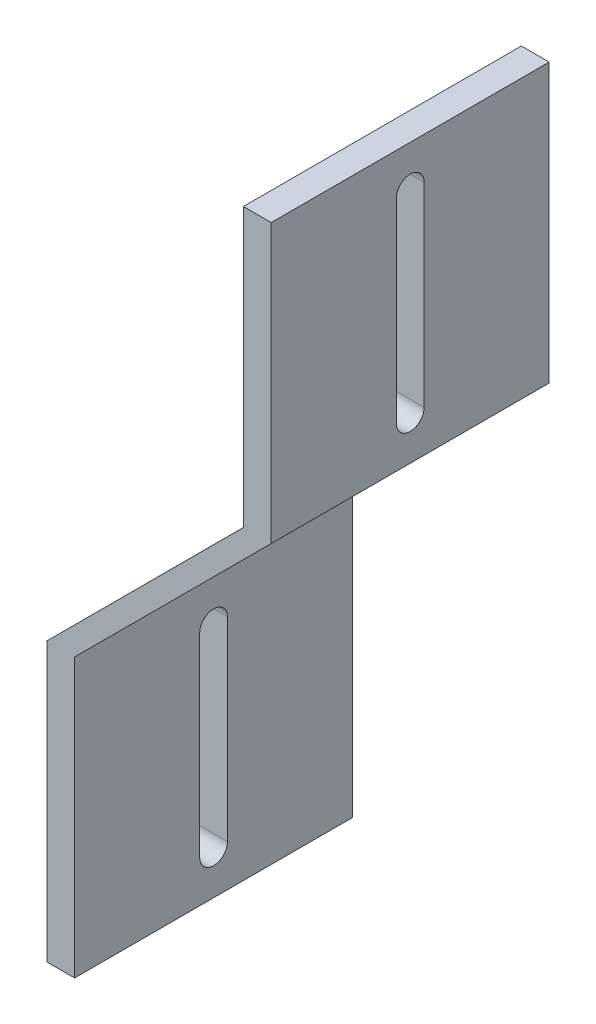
ISO-10303-21;
HEADER;
FILE_DESCRIPTION(('STEP AP214'),'2;1');
FILE_NAME('part.step','',(''),(''),'','','');
FILE_SCHEMA(('AUTOMOTIVE_DESIGN { 1 0 10303 214 1 1 1 1 }'));
ENDSEC;
DATA;
#1=APPLICATION_CONTEXT('core data for automotive mechanical design processes');
#2=APPLICATION_PROTOCOL_DEFINITION('international standard','automotive_design',2000,#1);
#3=PRODUCT_CONTEXT('',#1,'mechanical');
#4=PRODUCT('Part','Part','',(#3));
#5=PRODUCT_RELATED_PRODUCT_CATEGORY('part','',(#4));
#6=PRODUCT_DEFINITION_FORMATION('','',#4);
#7=PRODUCT_DEFINITION_CONTEXT('part definition',#1,'design');
#8=PRODUCT_DEFINITION('design','',#6,#7);
#9=PRODUCT_DEFINITION_SHAPE('','',#8);
#10=(LENGTH_UNIT() NAMED_UNIT(*) SI_UNIT(.MILLI.,.METRE.));
#11=(NAMED_UNIT(*) PLANE_ANGLE_UNIT() SI_UNIT($,.RADIAN.));
#12=(NAMED_UNIT(*) SI_UNIT($,.STERADIAN.) SOLID_ANGLE_UNIT());
#13=UNCERTAINTY_MEASURE_WITH_UNIT(LENGTH_MEASURE(1.E-05),#10,'distance_accuracy_value','');
#14=(GEOMETRIC_REPRESENTATION_CONTEXT(3) GLOBAL_UNCERTAINTY_ASSIGNED_CONTEXT((#13)) GLOBAL_UNIT_ASSIGNED_CONTEXT((#10,
#11,#12)) REPRESENTATION_CONTEXT('',''));
#15=CARTESIAN_POINT('',(0.,0.,0.));
#16=DIRECTION('',(0.,0.,1.));
#17=DIRECTION('',(1.,0.,0.));
#18=AXIS2_PLACEMENT_3D('',#15,#16,#17);
#19=CARTESIAN_POINT('',(12.0270056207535,39.6279642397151,50.8));
#20=DIRECTION('',(-1.,0.,0.));
#21=DIRECTION('',(0.,-1.,0.));
#22=AXIS2_PLACEMENT_3D('',#19,#20,#21);
#23=PLANE('',#22);
#24=DIRECTION('',(0.,-1.,0.));
#25=VECTOR('',#24,1.);
#26=CARTESIAN_POINT('',(12.0270056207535,-3.55203576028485,22.86));
#27=LINE('',#26,#25);
#28=CARTESIAN_POINT('',(12.0270056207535,32.0079642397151,22.86));
#29=VERTEX_POINT('',#28);
#30=CARTESIAN_POINT('',(12.0270056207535,-3.55203576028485,22.86));
#31=VERTEX_POINT('',#30);
#32=EDGE_CURVE('E153',#29,#31,#27,.T.);
#33=ORIENTED_EDGE('',*,*,#32,.T.);
#34=CARTESIAN_POINT('',(12.0270056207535,-3.55203576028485,25.4));
#35=DIRECTION('',(-1.,0.,0.));
#36=DIRECTION('',(0.,-1.,0.));
#37=AXIS2_PLACEMENT_3D('',#34,#35,#36);
#38=CIRCLE('',#37,2.54);
#39=CARTESIAN_POINT('',(12.0270056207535,-3.55203576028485,27.94));
#40=VERTEX_POINT('',#39);
#41=EDGE_CURVE('E147',#31,#40,#38,.T.);
#42=ORIENTED_EDGE('',*,*,#41,.T.);
#43=DIRECTION('',(0.,1.,0.));
#44=VECTOR('',#43,1.);
#45=CARTESIAN_POINT('',(12.0270056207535,-3.55203576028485,27.94));
#46=LINE('',#45,#44);
#47=CARTESIAN_POINT('',(12.0270056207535,32.0079642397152,27.94));
#48=VERTEX_POINT('',#47);
#49=EDGE_CURVE('E156',#40,#48,#46,.T.);
#50=ORIENTED_EDGE('',*,*,#49,.T.);
#51=CARTESIAN_POINT('',(12.0270056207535,32.0079642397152,25.4));
#52=DIRECTION('',(-1.,0.,0.));
#53=DIRECTION('',(0.,-1.,0.));
#54=AXIS2_PLACEMENT_3D('',#51,#52,#53);
#55=CIRCLE('',#54,2.54);
#56=EDGE_CURVE('E47',#48,#29,#55,.T.);
#57=ORIENTED_EDGE('',*,*,#56,.T.);
#58=EDGE_LOOP('',(#33,#42,#50,#57));
#59=FACE_BOUND('',#58,.T.);
#60=DIRECTION('',(0.,1.,0.));
#61=VECTOR('',#60,1.);
#62=CARTESIAN_POINT('',(12.0270056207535,39.6279642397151,0.));
#63=LINE('',#62,#61);
#64=CARTESIAN_POINT('',(12.0270056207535,-11.1720357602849,0.));
#65=VERTEX_POINT('',#64);
#66=CARTESIAN_POINT('',(12.0270056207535,39.6279642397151,0.));
#67=VERTEX_POINT('',#66);
#68=EDGE_CURVE('E206',#65,#67,#63,.T.);
#69=ORIENTED_EDGE('',*,*,#68,.T.);
#70=DIRECTION('',(0.,0.,-1.));
#71=VECTOR('',#70,1.);
#72=CARTESIAN_POINT('',(12.0270056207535,39.6279642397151,50.8));
#73=LINE('',#72,#71);
#74=CARTESIAN_POINT('',(12.0270056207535,39.6279642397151,50.8));
#75=VERTEX_POINT('',#74);
#76=EDGE_CURVE('E11',#75,#67,#73,.T.);
#77=ORIENTED_EDGE('',*,*,#76,.F.);
#78=DIRECTION('',(0.,1.,0.));
#79=VECTOR('',#78,1.);
#80=CARTESIAN_POINT('',(12.0270056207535,39.6279642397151,50.8));
#81=LINE('',#80,#79);
#82=CARTESIAN_POINT('',(12.0270056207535,-11.1720357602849,50.8));
#83=VERTEX_POINT('',#82);
#84=EDGE_CURVE('E213',#83,#75,#81,.T.);
#85=ORIENTED_EDGE('',*,*,#84,.F.);
#86=DIRECTION('',(0.,0.,-1.));
#87=VECTOR('',#86,1.);
#88=CARTESIAN_POINT('',(12.0270056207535,-11.1720357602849,50.8));
#89=LINE('',#88,#87);
#90=EDGE_CURVE('E231',#83,#65,#89,.T.);
#91=ORIENTED_EDGE('',*,*,#90,.T.);
#92=EDGE_LOOP('',(#69,#77,#85,#91));
#93=FACE_BOUND('',#92,.T.);
#94=ADVANCED_FACE('F33',(#59,#93),#23,.F.);
#95=CARTESIAN_POINT('',(12.0270056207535,39.6279642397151,50.8));
#96=DIRECTION('',(-0.707,0.707213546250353,0.));
#97=DIRECTION('',(-0.707213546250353,-0.707,0.));
#98=AXIS2_PLACEMENT_3D('',#95,#96,#97);
#99=PLANE('',#98);
#100=DIRECTION('',(0.707213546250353,0.707,0.));
#101=VECTOR('',#100,1.);
#102=CARTESIAN_POINT('',(12.0270056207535,39.6279642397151,0.));
#103=LINE('',#102,#101);
#104=CARTESIAN_POINT('',(47.9534537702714,75.5435642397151,0.));
#105=VERTEX_POINT('',#104);
#106=EDGE_CURVE('E234',#67,#105,#103,.T.);
#107=ORIENTED_EDGE('',*,*,#106,.T.);
#108=DIRECTION('',(0.,0.,-1.));
#109=VECTOR('',#108,1.);
#110=CARTESIAN_POINT('',(47.9534537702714,75.5435642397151,50.8));
#111=LINE('',#110,#109);
#112=CARTESIAN_POINT('',(47.9534537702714,75.5435642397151,50.8));
#113=VERTEX_POINT('',#112);
#114=EDGE_CURVE('E40',#113,#105,#111,.T.);
#115=ORIENTED_EDGE('',*,*,#114,.F.);
#116=DIRECTION('',(0.707213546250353,0.707,0.));
#117=VECTOR('',#116,1.);
#118=CARTESIAN_POINT('',(12.0270056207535,39.6279642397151,50.8));
#119=LINE('',#118,#117);
#120=EDGE_CURVE('E216',#75,#113,#119,.T.);
#121=ORIENTED_EDGE('',*,*,#120,.F.);
#122=ORIENTED_EDGE('',*,*,#76,.T.);
#123=EDGE_LOOP('',(#107,#115,#121,#122));
#124=FACE_BOUND('',#123,.T.);
#125=ADVANCED_FACE('F291',(#124),#99,.F.);
#126=CARTESIAN_POINT('',(47.9534537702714,126.343564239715,50.8));
#127=DIRECTION('',(-1.,0.,0.));
#128=DIRECTION('',(0.,-1.,0.));
#129=AXIS2_PLACEMENT_3D('',#126,#127,#128);
#130=PLANE('',#129);
#131=DIRECTION('',(0.,-1.,0.));
#132=VECTOR('',#131,1.);
#133=CARTESIAN_POINT('',(47.9534537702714,83.1293378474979,22.86));
#134=LINE('',#133,#132);
#135=CARTESIAN_POINT('',(47.9534537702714,118.757790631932,22.86));
#136=VERTEX_POINT('',#135);
#137=CARTESIAN_POINT('',(47.9534537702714,83.1293378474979,22.86));
#138=VERTEX_POINT('',#137);
#139=EDGE_CURVE('E191',#136,#138,#134,.T.);
#140=ORIENTED_EDGE('',*,*,#139,.T.);
#141=CARTESIAN_POINT('',(47.9534537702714,83.1293378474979,25.4));
#142=DIRECTION('',(-1.,0.,0.));
#143=DIRECTION('',(0.,-1.,0.));
#144=AXIS2_PLACEMENT_3D('',#141,#142,#143);
#145=CIRCLE('',#144,2.54);
#146=CARTESIAN_POINT('',(47.9534537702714,83.1293378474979,27.94));
#147=VERTEX_POINT('',#146);
#148=EDGE_CURVE('E181',#138,#147,#145,.T.);
#149=ORIENTED_EDGE('',*,*,#148,.T.);
#150=DIRECTION('',(0.,1.,0.));
#151=VECTOR('',#150,1.);
#152=CARTESIAN_POINT('',(47.9534537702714,83.1293378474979,27.94));
#153=LINE('',#152,#151);
#154=CARTESIAN_POINT('',(47.9534537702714,118.757790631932,27.94));
#155=VERTEX_POINT('',#154);
#156=EDGE_CURVE('E184',#147,#155,#153,.T.);
#157=ORIENTED_EDGE('',*,*,#156,.T.);
#158=CARTESIAN_POINT('',(47.9534537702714,118.757790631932,25.4));
#159=DIRECTION('',(-1.,0.,0.));
#160=DIRECTION('',(0.,-1.,0.));
#161=AXIS2_PLACEMENT_3D('',#158,#159,#160);
#162=CIRCLE('',#161,2.54);
#163=EDGE_CURVE('E188',#155,#136,#162,.T.);
#164=ORIENTED_EDGE('',*,*,#163,.T.);
#165=EDGE_LOOP('',(#140,#149,#157,#164));
#166=FACE_BOUND('',#165,.T.);
#167=DIRECTION('',(0.,1.,0.));
#168=VECTOR('',#167,1.);
#169=CARTESIAN_POINT('',(47.9534537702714,126.343564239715,0.));
#170=LINE('',#169,#168);
#171=CARTESIAN_POINT('',(47.9534537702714,126.343564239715,0.));
#172=VERTEX_POINT('',#171);
#173=EDGE_CURVE('E236',#105,#172,#170,.T.);
#174=ORIENTED_EDGE('',*,*,#173,.T.);
#175=DIRECTION('',(0.,0.,-1.));
#176=VECTOR('',#175,1.);
#177=CARTESIAN_POINT('',(47.9534537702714,126.343564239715,50.8));
#178=LINE('',#177,#176);
#179=CARTESIAN_POINT('',(47.9534537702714,126.343564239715,50.8));
#180=VERTEX_POINT('',#179);
#181=EDGE_CURVE('E261',#180,#172,#178,.T.);
#182=ORIENTED_EDGE('',*,*,#181,.F.);
#183=DIRECTION('',(0.,1.,0.));
#184=VECTOR('',#183,1.);
#185=CARTESIAN_POINT('',(47.9534537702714,126.343564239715,50.8));
#186=LINE('',#185,#184);
#187=EDGE_CURVE('E219',#113,#180,#186,.T.);
#188=ORIENTED_EDGE('',*,*,#187,.F.);
#189=ORIENTED_EDGE('',*,*,#114,.T.);
#190=EDGE_LOOP('',(#174,#182,#188,#189));
#191=FACE_BOUND('',#190,.T.);
#192=ADVANCED_FACE('F268',(#166,#191),#130,.F.);
#193=CARTESIAN_POINT('',(42.8734537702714,126.343564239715,50.8));
#194=DIRECTION('',(0.,-1.,0.));
#195=DIRECTION('',(0.,0.,-1.));
#196=AXIS2_PLACEMENT_3D('',#193,#194,#195);
#197=PLANE('',#196);
#198=DIRECTION('',(-1.,0.,0.));
#199=VECTOR('',#198,1.);
#200=CARTESIAN_POINT('',(42.8734537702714,126.343564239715,0.));
#201=LINE('',#200,#199);
#202=CARTESIAN_POINT('',(42.8734537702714,126.343564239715,0.));
#203=VERTEX_POINT('',#202);
#204=EDGE_CURVE('E238',#172,#203,#201,.T.);
#205=ORIENTED_EDGE('',*,*,#204,.T.);
#206=DIRECTION('',(0.,0.,-1.));
#207=VECTOR('',#206,1.);
#208=CARTESIAN_POINT('',(42.8734537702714,126.343564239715,50.8));
#209=LINE('',#208,#207);
#210=CARTESIAN_POINT('',(42.8734537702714,126.343564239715,50.8));
#211=VERTEX_POINT('',#210);
#212=EDGE_CURVE('E258',#211,#203,#209,.T.);
#213=ORIENTED_EDGE('',*,*,#212,.F.);
#214=DIRECTION('',(-1.,0.,0.));
#215=VECTOR('',#214,1.);
#216=CARTESIAN_POINT('',(42.8734537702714,126.343564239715,50.8));
#217=LINE('',#216,#215);
#218=EDGE_CURVE('E221',#180,#211,#217,.T.);
#219=ORIENTED_EDGE('',*,*,#218,.F.);
#220=ORIENTED_EDGE('',*,*,#181,.T.);
#221=EDGE_LOOP('',(#205,#213,#219,#220));
#222=FACE_BOUND('',#221,.T.);
#223=ADVANCED_FACE('F279',(#222),#197,.F.);
#224=CARTESIAN_POINT('',(42.8734537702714,126.343564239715,50.8));
#225=DIRECTION('',(1.,0.,0.));
#226=DIRECTION('',(0.,1.,0.));
#227=AXIS2_PLACEMENT_3D('',#224,#225,#226);
#228=PLANE('',#227);
#229=DIRECTION('',(0.,1.,0.));
#230=VECTOR('',#229,1.);
#231=CARTESIAN_POINT('',(42.8734537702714,83.1293378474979,27.94));
#232=LINE('',#231,#230);
#233=CARTESIAN_POINT('',(42.8734537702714,83.1293378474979,27.94));
#234=VERTEX_POINT('',#233);
#235=CARTESIAN_POINT('',(42.8734537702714,118.757790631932,27.94));
#236=VERTEX_POINT('',#235);
#237=EDGE_CURVE('E196',#234,#236,#232,.T.);
#238=ORIENTED_EDGE('',*,*,#237,.F.);
#239=CARTESIAN_POINT('',(42.8734537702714,83.1293378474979,25.4));
#240=DIRECTION('',(-1.,0.,0.));
#241=DIRECTION('',(0.,-1.,0.));
#242=AXIS2_PLACEMENT_3D('',#239,#240,#241);
#243=CIRCLE('',#242,2.54);
#244=CARTESIAN_POINT('',(42.8734537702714,83.1293378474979,22.86));
#245=VERTEX_POINT('',#244);
#246=EDGE_CURVE('E177',#245,#234,#243,.T.);
#247=ORIENTED_EDGE('',*,*,#246,.F.);
#248=DIRECTION('',(0.,-1.,0.));
#249=VECTOR('',#248,1.);
#250=CARTESIAN_POINT('',(42.8734537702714,83.1293378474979,22.86));
#251=LINE('',#250,#249);
#252=CARTESIAN_POINT('',(42.8734537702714,118.757790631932,22.86));
#253=VERTEX_POINT('',#252);
#254=EDGE_CURVE('E185',#253,#245,#251,.T.);
#255=ORIENTED_EDGE('',*,*,#254,.F.);
#256=CARTESIAN_POINT('',(42.8734537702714,118.757790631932,25.4));
#257=DIRECTION('',(-1.,0.,0.));
#258=DIRECTION('',(0.,-1.,0.));
#259=AXIS2_PLACEMENT_3D('',#256,#257,#258);
#260=CIRCLE('',#259,2.54);
#261=EDGE_CURVE('E199',#236,#253,#260,.T.);
#262=ORIENTED_EDGE('',*,*,#261,.F.);
#263=EDGE_LOOP('',(#238,#247,#255,#262));
#264=FACE_BOUND('',#263,.T.);
#265=DIRECTION('',(0.,-1.,0.));
#266=VECTOR('',#265,1.);
#267=CARTESIAN_POINT('',(42.8734537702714,126.343564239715,0.));
#268=LINE('',#267,#266);
#269=CARTESIAN_POINT('',(42.8734537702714,75.5435642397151,0.));
#270=VERTEX_POINT('',#269);
#271=EDGE_CURVE('E240',#203,#270,#268,.T.);
#272=ORIENTED_EDGE('',*,*,#271,.T.);
#273=DIRECTION('',(0.,0.,-1.));
#274=VECTOR('',#273,1.);
#275=CARTESIAN_POINT('',(42.8734537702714,75.5435642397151,50.8));
#276=LINE('',#275,#274);
#277=CARTESIAN_POINT('',(42.8734537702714,75.5435642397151,50.8));
#278=VERTEX_POINT('',#277);
#279=EDGE_CURVE('E255',#278,#270,#276,.T.);
#280=ORIENTED_EDGE('',*,*,#279,.F.);
#281=DIRECTION('',(0.,-1.,0.));
#282=VECTOR('',#281,1.);
#283=CARTESIAN_POINT('',(42.8734537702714,126.343564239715,50.8));
#284=LINE('',#283,#282);
#285=EDGE_CURVE('E223',#211,#278,#284,.T.);
#286=ORIENTED_EDGE('',*,*,#285,.F.);
#287=ORIENTED_EDGE('',*,*,#212,.T.);
#288=EDGE_LOOP('',(#272,#280,#286,#287));
#289=FACE_BOUND('',#288,.T.);
#290=ADVANCED_FACE('F283',(#264,#289),#228,.F.);
#291=CARTESIAN_POINT('',(6.94700562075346,39.6279642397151,50.8));
#292=DIRECTION('',(0.707,-0.707213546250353,0.));
#293=DIRECTION('',(0.707213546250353,0.707,0.));
#294=AXIS2_PLACEMENT_3D('',#291,#292,#293);
#295=PLANE('',#294);
#296=DIRECTION('',(-0.707213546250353,-0.707,0.));
#297=VECTOR('',#296,1.);
#298=CARTESIAN_POINT('',(6.94700562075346,39.6279642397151,0.));
#299=LINE('',#298,#297);
#300=CARTESIAN_POINT('',(6.94700562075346,39.6279642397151,0.));
#301=VERTEX_POINT('',#300);
#302=EDGE_CURVE('E242',#270,#301,#299,.T.);
#303=ORIENTED_EDGE('',*,*,#302,.T.);
#304=DIRECTION('',(0.,0.,-1.));
#305=VECTOR('',#304,1.);
#306=CARTESIAN_POINT('',(6.94700562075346,39.6279642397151,50.8));
#307=LINE('',#306,#305);
#308=CARTESIAN_POINT('',(6.94700562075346,39.6279642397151,50.8));
#309=VERTEX_POINT('',#308);
#310=EDGE_CURVE('E252',#309,#301,#307,.T.);
#311=ORIENTED_EDGE('',*,*,#310,.F.);
#312=DIRECTION('',(-0.707213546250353,-0.707,0.));
#313=VECTOR('',#312,1.);
#314=CARTESIAN_POINT('',(6.94700562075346,39.6279642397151,50.8));
#315=LINE('',#314,#313);
#316=EDGE_CURVE('E225',#278,#309,#315,.T.);
#317=ORIENTED_EDGE('',*,*,#316,.F.);
#318=ORIENTED_EDGE('',*,*,#279,.T.);
#319=EDGE_LOOP('',(#303,#311,#317,#318));
#320=FACE_BOUND('',#319,.T.);
#321=ADVANCED_FACE('F303',(#320),#295,.F.);
#322=CARTESIAN_POINT('',(6.94700562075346,39.6279642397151,50.8));
#323=DIRECTION('',(1.,0.,0.));
#324=DIRECTION('',(0.,1.,0.));
#325=AXIS2_PLACEMENT_3D('',#322,#323,#324);
#326=PLANE('',#325);
#327=DIRECTION('',(0.,1.,0.));
#328=VECTOR('',#327,1.);
#329=CARTESIAN_POINT('',(6.94700562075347,-3.55203576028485,27.94));
#330=LINE('',#329,#328);
#331=CARTESIAN_POINT('',(6.94700562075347,-3.55203576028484,27.94));
#332=VERTEX_POINT('',#331);
#333=CARTESIAN_POINT('',(6.94700562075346,32.0079642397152,27.94));
#334=VERTEX_POINT('',#333);
#335=EDGE_CURVE('E171',#332,#334,#330,.T.);
#336=ORIENTED_EDGE('',*,*,#335,.F.);
#337=CARTESIAN_POINT('',(6.94700562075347,-3.55203576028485,25.4));
#338=DIRECTION('',(-1.,0.,0.));
#339=DIRECTION('',(0.,-1.,0.));
#340=AXIS2_PLACEMENT_3D('',#337,#338,#339);
#341=CIRCLE('',#340,2.54);
#342=CARTESIAN_POINT('',(6.94700562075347,-3.55203576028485,22.86));
#343=VERTEX_POINT('',#342);
#344=EDGE_CURVE('E55',#343,#332,#341,.T.);
#345=ORIENTED_EDGE('',*,*,#344,.F.);
#346=DIRECTION('',(0.,-1.,0.));
#347=VECTOR('',#346,1.);
#348=CARTESIAN_POINT('',(6.94700562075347,-3.55203576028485,22.86));
#349=LINE('',#348,#347);
#350=CARTESIAN_POINT('',(6.94700562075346,32.0079642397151,22.86));
#351=VERTEX_POINT('',#350);
#352=EDGE_CURVE('E162',#351,#343,#349,.T.);
#353=ORIENTED_EDGE('',*,*,#352,.F.);
#354=CARTESIAN_POINT('',(6.94700562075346,32.0079642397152,25.4));
#355=DIRECTION('',(-1.,0.,0.));
#356=DIRECTION('',(0.,-1.,0.));
#357=AXIS2_PLACEMENT_3D('',#354,#355,#356);
#358=CIRCLE('',#357,2.54);
#359=EDGE_CURVE('E165',#334,#351,#358,.T.);
#360=ORIENTED_EDGE('',*,*,#359,.F.);
#361=EDGE_LOOP('',(#336,#345,#353,#360));
#362=FACE_BOUND('',#361,.T.);
#363=DIRECTION('',(0.,-1.,0.));
#364=VECTOR('',#363,1.);
#365=CARTESIAN_POINT('',(6.94700562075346,39.6279642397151,0.));
#366=LINE('',#365,#364);
#367=CARTESIAN_POINT('',(6.94700562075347,-11.1720357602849,0.));
#368=VERTEX_POINT('',#367);
#369=EDGE_CURVE('E244',#301,#368,#366,.T.);
#370=ORIENTED_EDGE('',*,*,#369,.T.);
#371=DIRECTION('',(0.,0.,-1.));
#372=VECTOR('',#371,1.);
#373=CARTESIAN_POINT('',(6.94700562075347,-11.1720357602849,50.8));
#374=LINE('',#373,#372);
#375=CARTESIAN_POINT('',(6.94700562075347,-11.1720357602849,50.8));
#376=VERTEX_POINT('',#375);
#377=EDGE_CURVE('E249',#376,#368,#374,.T.);
#378=ORIENTED_EDGE('',*,*,#377,.F.);
#379=DIRECTION('',(0.,-1.,0.));
#380=VECTOR('',#379,1.);
#381=CARTESIAN_POINT('',(6.94700562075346,39.6279642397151,50.8));
#382=LINE('',#381,#380);
#383=EDGE_CURVE('E227',#309,#376,#382,.T.);
#384=ORIENTED_EDGE('',*,*,#383,.F.);
#385=ORIENTED_EDGE('',*,*,#310,.T.);
#386=EDGE_LOOP('',(#370,#378,#384,#385));
#387=FACE_BOUND('',#386,.T.);
#388=ADVANCED_FACE('F301',(#362,#387),#326,.F.);
#389=CARTESIAN_POINT('',(6.94700562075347,-11.1720357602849,50.8));
#390=DIRECTION('',(0.,1.,0.));
#391=DIRECTION('',(0.,0.,1.));
#392=AXIS2_PLACEMENT_3D('',#389,#390,#391);
#393=PLANE('',#392);
#394=DIRECTION('',(1.,0.,0.));
#395=VECTOR('',#394,1.);
#396=CARTESIAN_POINT('',(6.94700562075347,-11.1720357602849,0.));
#397=LINE('',#396,#395);
#398=EDGE_CURVE('E217',#368,#65,#397,.T.);
#399=ORIENTED_EDGE('',*,*,#398,.T.);
#400=ORIENTED_EDGE('',*,*,#90,.F.);
#401=DIRECTION('',(1.,0.,0.));
#402=VECTOR('',#401,1.);
#403=CARTESIAN_POINT('',(6.94700562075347,-11.1720357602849,50.8));
#404=LINE('',#403,#402);
#405=EDGE_CURVE('E229',#376,#83,#404,.T.);
#406=ORIENTED_EDGE('',*,*,#405,.F.);
#407=ORIENTED_EDGE('',*,*,#377,.T.);
#408=EDGE_LOOP('',(#399,#400,#406,#407));
#409=FACE_BOUND('',#408,.T.);
#410=ADVANCED_FACE('F296',(#409),#393,.F.);
#411=CARTESIAN_POINT('',(0.,0.,50.8));
#412=DIRECTION('',(0.,0.,1.));
#413=DIRECTION('',(1.,0.,0.));
#414=AXIS2_PLACEMENT_3D('',#411,#412,#413);
#415=PLANE('',#414);
#416=ORIENTED_EDGE('',*,*,#84,.T.);
#417=ORIENTED_EDGE('',*,*,#120,.T.);
#418=ORIENTED_EDGE('',*,*,#187,.T.);
#419=ORIENTED_EDGE('',*,*,#218,.T.);
#420=ORIENTED_EDGE('',*,*,#285,.T.);
#421=ORIENTED_EDGE('',*,*,#316,.T.);
#422=ORIENTED_EDGE('',*,*,#383,.T.);
#423=ORIENTED_EDGE('',*,*,#405,.T.);
#424=EDGE_LOOP('',(#416,#417,#418,#419,#420,#421,#422,#423));
#425=FACE_BOUND('',#424,.T.);
#426=ADVANCED_FACE('F287',(#425),#415,.T.);
#427=CARTESIAN_POINT('',(0.,0.,0.));
#428=DIRECTION('',(0.,0.,1.));
#429=DIRECTION('',(1.,0.,0.));
#430=AXIS2_PLACEMENT_3D('',#427,#428,#429);
#431=PLANE('',#430);
#432=ORIENTED_EDGE('',*,*,#68,.F.);
#433=ORIENTED_EDGE('',*,*,#398,.F.);
#434=ORIENTED_EDGE('',*,*,#369,.F.);
#435=ORIENTED_EDGE('',*,*,#302,.F.);
#436=ORIENTED_EDGE('',*,*,#271,.F.);
#437=ORIENTED_EDGE('',*,*,#204,.F.);
#438=ORIENTED_EDGE('',*,*,#173,.F.);
#439=ORIENTED_EDGE('',*,*,#106,.F.);
#440=EDGE_LOOP('',(#432,#433,#434,#435,#436,#437,#438,#439));
#441=FACE_BOUND('',#440,.T.);
#442=ADVANCED_FACE('F274',(#441),#431,.F.);
#443=CARTESIAN_POINT('',(47.9534537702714,83.1293378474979,25.4));
#444=DIRECTION('',(-1.,0.,0.));
#445=DIRECTION('',(0.,-1.,0.));
#446=AXIS2_PLACEMENT_3D('',#443,#444,#445);
#447=CYLINDRICAL_SURFACE('',#446,2.54);
#448=ORIENTED_EDGE('',*,*,#246,.T.);
#449=DIRECTION('',(-1.,0.,0.));
#450=VECTOR('',#449,1.);
#451=CARTESIAN_POINT('',(47.9534537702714,83.1293378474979,27.94));
#452=LINE('',#451,#450);
#453=EDGE_CURVE('E194',#147,#234,#452,.T.);
#454=ORIENTED_EDGE('',*,*,#453,.F.);
#455=ORIENTED_EDGE('',*,*,#148,.F.);
#456=DIRECTION('',(-1.,0.,0.));
#457=VECTOR('',#456,1.);
#458=CARTESIAN_POINT('',(47.9534537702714,83.1293378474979,22.86));
#459=LINE('',#458,#457);
#460=EDGE_CURVE('E204',#138,#245,#459,.T.);
#461=ORIENTED_EDGE('',*,*,#460,.T.);
#462=EDGE_LOOP('',(#448,#454,#455,#461));
#463=FACE_BOUND('',#462,.T.);
#464=ADVANCED_FACE('F342',(#463),#447,.F.);
#465=CARTESIAN_POINT('',(47.9534537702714,83.1293378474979,22.86));
#466=DIRECTION('',(0.,0.,-1.));
#467=DIRECTION('',(0.,1.,0.));
#468=AXIS2_PLACEMENT_3D('',#465,#466,#467);
#469=PLANE('',#468);
#470=ORIENTED_EDGE('',*,*,#254,.T.);
#471=ORIENTED_EDGE('',*,*,#460,.F.);
#472=ORIENTED_EDGE('',*,*,#139,.F.);
#473=DIRECTION('',(-1.,0.,0.));
#474=VECTOR('',#473,1.);
#475=CARTESIAN_POINT('',(47.9534537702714,118.757790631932,22.86));
#476=LINE('',#475,#474);
#477=EDGE_CURVE('E207',#136,#253,#476,.T.);
#478=ORIENTED_EDGE('',*,*,#477,.T.);
#479=EDGE_LOOP('',(#470,#471,#472,#478));
#480=FACE_BOUND('',#479,.T.);
#481=ADVANCED_FACE('F347',(#480),#469,.F.);
#482=CARTESIAN_POINT('',(47.9534537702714,118.757790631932,25.4));
#483=DIRECTION('',(-1.,0.,0.));
#484=DIRECTION('',(0.,-1.,0.));
#485=AXIS2_PLACEMENT_3D('',#482,#483,#484);
#486=CYLINDRICAL_SURFACE('',#485,2.54);
#487=ORIENTED_EDGE('',*,*,#261,.T.);
#488=ORIENTED_EDGE('',*,*,#477,.F.);
#489=ORIENTED_EDGE('',*,*,#163,.F.);
#490=DIRECTION('',(-1.,0.,0.));
#491=VECTOR('',#490,1.);
#492=CARTESIAN_POINT('',(47.9534537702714,118.757790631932,27.94));
#493=LINE('',#492,#491);
#494=EDGE_CURVE('E209',#155,#236,#493,.T.);
#495=ORIENTED_EDGE('',*,*,#494,.T.);
#496=EDGE_LOOP('',(#487,#488,#489,#495));
#497=FACE_BOUND('',#496,.T.);
#498=ADVANCED_FACE('F359',(#497),#486,.F.);
#499=CARTESIAN_POINT('',(47.9534537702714,83.1293378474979,27.94));
#500=DIRECTION('',(0.,0.,1.));
#501=DIRECTION('',(0.,-1.,0.));
#502=AXIS2_PLACEMENT_3D('',#499,#500,#501);
#503=PLANE('',#502);
#504=ORIENTED_EDGE('',*,*,#237,.T.);
#505=ORIENTED_EDGE('',*,*,#494,.F.);
#506=ORIENTED_EDGE('',*,*,#156,.F.);
#507=ORIENTED_EDGE('',*,*,#453,.T.);
#508=EDGE_LOOP('',(#504,#505,#506,#507));
#509=FACE_BOUND('',#508,.T.);
#510=ADVANCED_FACE('F369',(#509),#503,.F.);
#511=CARTESIAN_POINT('',(12.0270056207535,-3.55203576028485,25.4));
#512=DIRECTION('',(-1.,0.,0.));
#513=DIRECTION('',(0.,-1.,0.));
#514=AXIS2_PLACEMENT_3D('',#511,#512,#513);
#515=CYLINDRICAL_SURFACE('',#514,2.54);
#516=ORIENTED_EDGE('',*,*,#344,.T.);
#517=DIRECTION('',(-1.,0.,0.));
#518=VECTOR('',#517,1.);
#519=CARTESIAN_POINT('',(12.0270056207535,-3.55203576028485,27.94));
#520=LINE('',#519,#518);
#521=EDGE_CURVE('E143',#40,#332,#520,.T.);
#522=ORIENTED_EDGE('',*,*,#521,.F.);
#523=ORIENTED_EDGE('',*,*,#41,.F.);
#524=DIRECTION('',(-1.,0.,0.));
#525=VECTOR('',#524,1.);
#526=CARTESIAN_POINT('',(12.0270056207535,-3.55203576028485,22.86));
#527=LINE('',#526,#525);
#528=EDGE_CURVE('E175',#31,#343,#527,.T.);
#529=ORIENTED_EDGE('',*,*,#528,.T.);
#530=EDGE_LOOP('',(#516,#522,#523,#529));
#531=FACE_BOUND('',#530,.T.);
#532=ADVANCED_FACE('F145',(#531),#515,.F.);
#533=CARTESIAN_POINT('',(12.0270056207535,-3.55203576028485,22.86));
#534=DIRECTION('',(0.,0.,-1.));
#535=DIRECTION('',(0.,1.,0.));
#536=AXIS2_PLACEMENT_3D('',#533,#534,#535);
#537=PLANE('',#536);
#538=ORIENTED_EDGE('',*,*,#352,.T.);
#539=ORIENTED_EDGE('',*,*,#528,.F.);
#540=ORIENTED_EDGE('',*,*,#32,.F.);
#541=DIRECTION('',(-1.,0.,0.));
#542=VECTOR('',#541,1.);
#543=CARTESIAN_POINT('',(12.0270056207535,32.0079642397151,22.86));
#544=LINE('',#543,#542);
#545=EDGE_CURVE('E178',#29,#351,#544,.T.);
#546=ORIENTED_EDGE('',*,*,#545,.T.);
#547=EDGE_LOOP('',(#538,#539,#540,#546));
#548=FACE_BOUND('',#547,.T.);
#549=ADVANCED_FACE('F401',(#548),#537,.F.);
#550=CARTESIAN_POINT('',(12.0270056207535,32.0079642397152,25.4));
#551=DIRECTION('',(-1.,0.,0.));
#552=DIRECTION('',(0.,-1.,0.));
#553=AXIS2_PLACEMENT_3D('',#550,#551,#552);
#554=CYLINDRICAL_SURFACE('',#553,2.54);
#555=ORIENTED_EDGE('',*,*,#359,.T.);
#556=ORIENTED_EDGE('',*,*,#545,.F.);
#557=ORIENTED_EDGE('',*,*,#56,.F.);
#558=DIRECTION('',(-1.,0.,0.));
#559=VECTOR('',#558,1.);
#560=CARTESIAN_POINT('',(12.0270056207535,32.0079642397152,27.94));
#561=LINE('',#560,#559);
#562=EDGE_CURVE('E152',#48,#334,#561,.T.);
#563=ORIENTED_EDGE('',*,*,#562,.T.);
#564=EDGE_LOOP('',(#555,#556,#557,#563));
#565=FACE_BOUND('',#564,.T.);
#566=ADVANCED_FACE('F410',(#565),#554,.F.);
#567=CARTESIAN_POINT('',(12.0270056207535,-3.55203576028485,27.94));
#568=DIRECTION('',(0.,0.,1.));
#569=DIRECTION('',(0.,-1.,0.));
#570=AXIS2_PLACEMENT_3D('',#567,#568,#569);
#571=PLANE('',#570);
#572=ORIENTED_EDGE('',*,*,#335,.T.);
#573=ORIENTED_EDGE('',*,*,#562,.F.);
#574=ORIENTED_EDGE('',*,*,#49,.F.);
#575=ORIENTED_EDGE('',*,*,#521,.T.);
#576=EDGE_LOOP('',(#572,#573,#574,#575));
#577=FACE_BOUND('',#576,.T.);
#578=ADVANCED_FACE('F157',(#577),#571,.F.);
#579=CLOSED_SHELL('',(#94,#125,#192,#223,#290,#321,#388,#410,#426,#442,#464,#481,#498,#510,#532,
#549,#566,#578));
#580=MANIFOLD_SOLID_BREP('B2',#579);
#581=ADVANCED_BREP_SHAPE_REPRESENTATION('',(#18,#580),#14);
#582=SHAPE_DEFINITION_REPRESENTATION(#9,#581);
ENDSEC;
END-ISO-10303-21;
